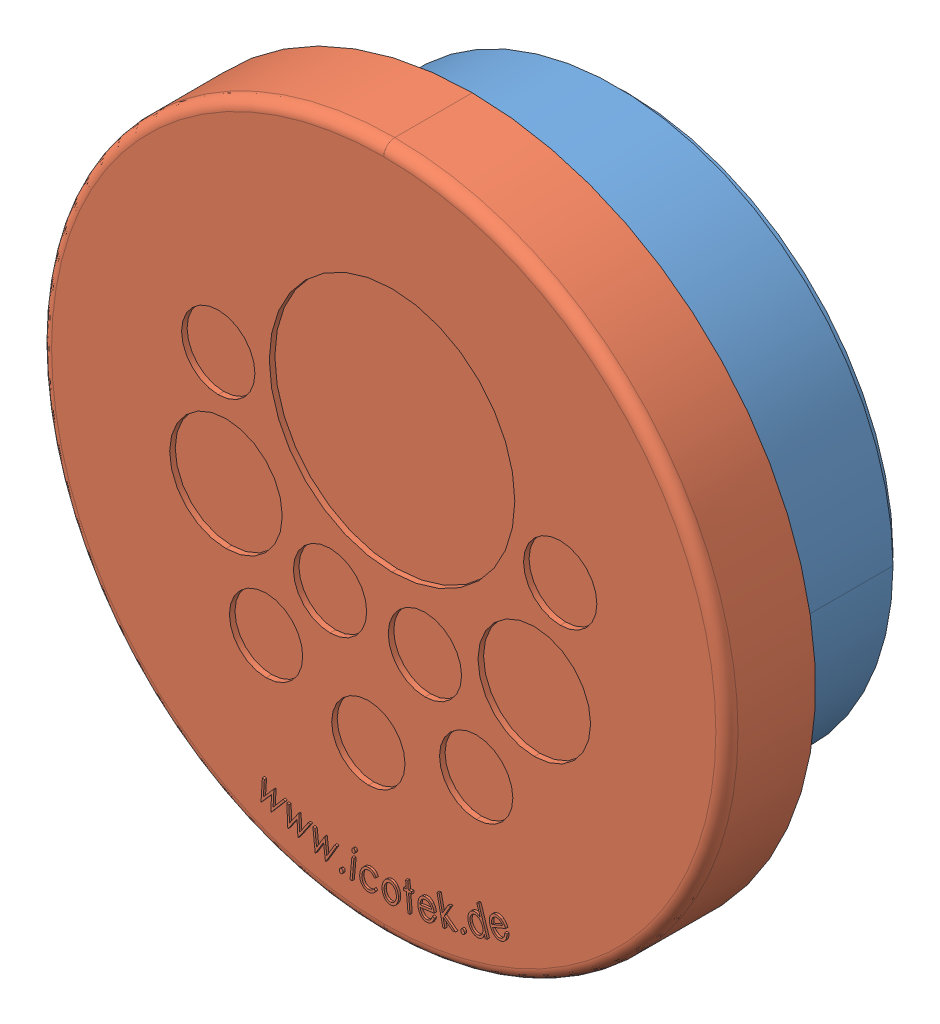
SolidWorks assembly 43751.SLDASM, configuration Default (file format 8000). Lengths in mm.
Overall size (62 62 22.2).
2 component instances, 2 part files, 0 mates.
Components (placement in the parent):
- 43751_01-1: 43751_01.SLDPRT [Default] at origin size (50 50 14)
- 43751_02-1: 43751_02.SLDPRT [Default] at origin size (62 62 8.2)
